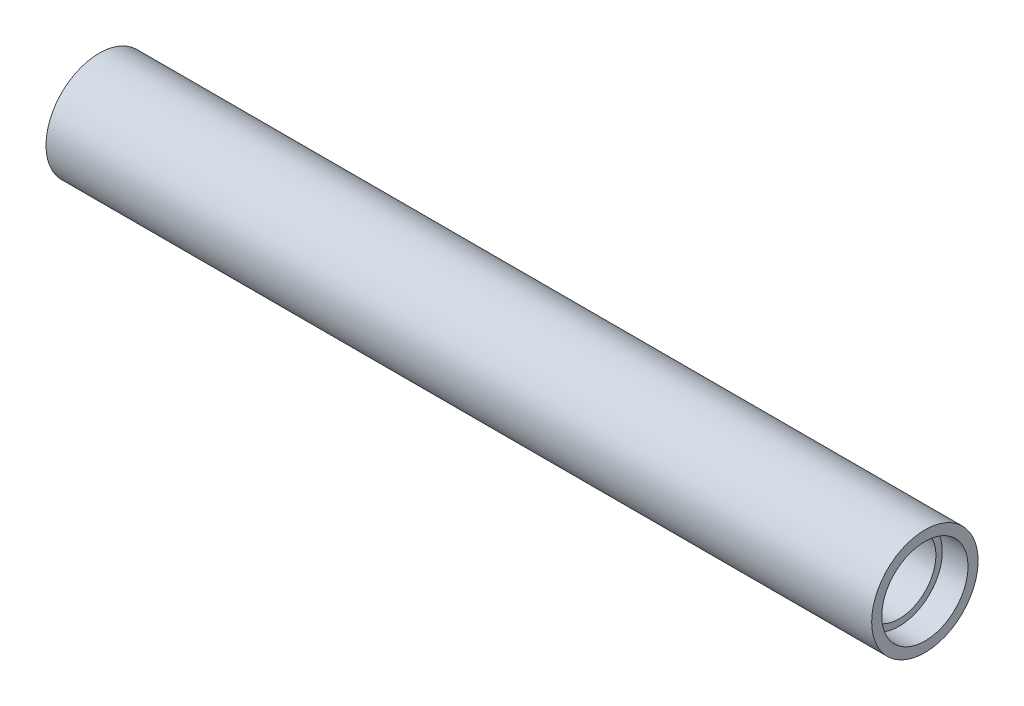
ISO-10303-21;
HEADER;
FILE_DESCRIPTION(('STEP AP214'),'2;1');
FILE_NAME('part.step','',(''),(''),'','','');
FILE_SCHEMA(('AUTOMOTIVE_DESIGN { 1 0 10303 214 1 1 1 1 }'));
ENDSEC;
DATA;
#1=APPLICATION_CONTEXT('core data for automotive mechanical design processes');
#2=APPLICATION_PROTOCOL_DEFINITION('international standard','automotive_design',2000,#1);
#3=PRODUCT_CONTEXT('',#1,'mechanical');
#4=PRODUCT('Part','Part','',(#3));
#5=PRODUCT_RELATED_PRODUCT_CATEGORY('part','',(#4));
#6=PRODUCT_DEFINITION_FORMATION('','',#4);
#7=PRODUCT_DEFINITION_CONTEXT('part definition',#1,'design');
#8=PRODUCT_DEFINITION('design','',#6,#7);
#9=PRODUCT_DEFINITION_SHAPE('','',#8);
#10=(LENGTH_UNIT() NAMED_UNIT(*) SI_UNIT(.MILLI.,.METRE.));
#11=(NAMED_UNIT(*) PLANE_ANGLE_UNIT() SI_UNIT($,.RADIAN.));
#12=(NAMED_UNIT(*) SI_UNIT($,.STERADIAN.) SOLID_ANGLE_UNIT());
#13=UNCERTAINTY_MEASURE_WITH_UNIT(LENGTH_MEASURE(1.E-05),#10,'distance_accuracy_value','');
#14=(GEOMETRIC_REPRESENTATION_CONTEXT(3) GLOBAL_UNCERTAINTY_ASSIGNED_CONTEXT((#13)) GLOBAL_UNIT_ASSIGNED_CONTEXT((#10,
#11,#12)) REPRESENTATION_CONTEXT('',''));
#15=CARTESIAN_POINT('',(0.,0.,0.));
#16=DIRECTION('',(0.,0.,1.));
#17=DIRECTION('',(1.,0.,0.));
#18=AXIS2_PLACEMENT_3D('',#15,#16,#17);
#19=CARTESIAN_POINT('',(225.,23.5000000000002,0.));
#20=DIRECTION('',(-1.,0.,0.));
#21=DIRECTION('',(0.,0.,1.));
#22=AXIS2_PLACEMENT_3D('',#19,#20,#21);
#23=PLANE('',#22);
#24=CARTESIAN_POINT('',(225.,0.,-4.44089209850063E-13));
#25=DIRECTION('',(-1.,0.,0.));
#26=DIRECTION('',(0.,0.,1.));
#27=AXIS2_PLACEMENT_3D('',#24,#25,#26);
#28=CIRCLE('',#27,29.);
#29=CARTESIAN_POINT('',(225.,0.,28.9999999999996));
#30=VERTEX_POINT('',#29);
#31=EDGE_CURVE('E70',#30,#30,#28,.T.);
#32=ORIENTED_EDGE('',*,*,#31,.F.);
#33=EDGE_LOOP('',(#32));
#34=FACE_BOUND('',#33,.T.);
#35=CARTESIAN_POINT('',(225.,0.,-4.44089209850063E-13));
#36=DIRECTION('',(-1.,0.,0.));
#37=DIRECTION('',(0.,0.,1.));
#38=AXIS2_PLACEMENT_3D('',#35,#36,#37);
#39=CIRCLE('',#38,23.5);
#40=CARTESIAN_POINT('',(225.,0.,23.4999999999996));
#41=VERTEX_POINT('',#40);
#42=EDGE_CURVE('E10',#41,#41,#39,.T.);
#43=ORIENTED_EDGE('',*,*,#42,.T.);
#44=EDGE_LOOP('',(#43));
#45=FACE_BOUND('',#44,.T.);
#46=ADVANCED_FACE('F34',(#34,#45),#23,.F.);
#47=CARTESIAN_POINT('',(-301.835158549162,0.,0.));
#48=DIRECTION('',(-1.,0.,0.));
#49=DIRECTION('',(0.,0.,1.));
#50=AXIS2_PLACEMENT_3D('',#47,#48,#49);
#51=CYLINDRICAL_SURFACE('',#50,23.5);
#52=ORIENTED_EDGE('',*,*,#42,.F.);
#53=EDGE_LOOP('',(#52));
#54=FACE_BOUND('',#53,.T.);
#55=CARTESIAN_POINT('',(211.,0.,0.));
#56=DIRECTION('',(-1.,0.,0.));
#57=DIRECTION('',(0.,0.,1.));
#58=AXIS2_PLACEMENT_3D('',#55,#56,#57);
#59=CIRCLE('',#58,23.5);
#60=CARTESIAN_POINT('',(211.,0.,23.5));
#61=VERTEX_POINT('',#60);
#62=EDGE_CURVE('E41',#61,#61,#59,.T.);
#63=ORIENTED_EDGE('',*,*,#62,.T.);
#64=EDGE_LOOP('',(#63));
#65=FACE_BOUND('',#64,.T.);
#66=ADVANCED_FACE('F77',(#54,#65),#51,.F.);
#67=CARTESIAN_POINT('',(211.,20.,0.));
#68=DIRECTION('',(-1.,0.,0.));
#69=DIRECTION('',(0.,0.,1.));
#70=AXIS2_PLACEMENT_3D('',#67,#68,#69);
#71=PLANE('',#70);
#72=ORIENTED_EDGE('',*,*,#62,.F.);
#73=EDGE_LOOP('',(#72));
#74=FACE_BOUND('',#73,.T.);
#75=CARTESIAN_POINT('',(211.,0.,0.));
#76=DIRECTION('',(-1.,0.,0.));
#77=DIRECTION('',(0.,0.,1.));
#78=AXIS2_PLACEMENT_3D('',#75,#76,#77);
#79=CIRCLE('',#78,20.);
#80=CARTESIAN_POINT('',(211.,0.,20.));
#81=VERTEX_POINT('',#80);
#82=EDGE_CURVE('E48',#81,#81,#79,.T.);
#83=ORIENTED_EDGE('',*,*,#82,.T.);
#84=EDGE_LOOP('',(#83));
#85=FACE_BOUND('',#84,.T.);
#86=ADVANCED_FACE('F81',(#74,#85),#71,.F.);
#87=CARTESIAN_POINT('',(-301.835158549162,0.,0.));
#88=DIRECTION('',(-1.,0.,0.));
#89=DIRECTION('',(0.,0.,1.));
#90=AXIS2_PLACEMENT_3D('',#87,#88,#89);
#91=CYLINDRICAL_SURFACE('',#90,20.);
#92=ORIENTED_EDGE('',*,*,#82,.F.);
#93=EDGE_LOOP('',(#92));
#94=FACE_BOUND('',#93,.T.);
#95=CARTESIAN_POINT('',(-211.,1.11022302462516E-13,0.));
#96=DIRECTION('',(-1.,0.,0.));
#97=DIRECTION('',(0.,0.,1.));
#98=AXIS2_PLACEMENT_3D('',#95,#96,#97);
#99=CIRCLE('',#98,20.);
#100=CARTESIAN_POINT('',(-211.,1.11022302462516E-13,20.));
#101=VERTEX_POINT('',#100);
#102=EDGE_CURVE('E54',#101,#101,#99,.T.);
#103=ORIENTED_EDGE('',*,*,#102,.T.);
#104=EDGE_LOOP('',(#103));
#105=FACE_BOUND('',#104,.T.);
#106=ADVANCED_FACE('F86',(#94,#105),#91,.F.);
#107=CARTESIAN_POINT('',(-211.,23.5,0.));
#108=DIRECTION('',(1.,0.,0.));
#109=DIRECTION('',(0.,0.,-1.));
#110=AXIS2_PLACEMENT_3D('',#107,#108,#109);
#111=PLANE('',#110);
#112=ORIENTED_EDGE('',*,*,#102,.F.);
#113=EDGE_LOOP('',(#112));
#114=FACE_BOUND('',#113,.T.);
#115=CARTESIAN_POINT('',(-211.,1.11022302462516E-13,0.));
#116=DIRECTION('',(-1.,0.,0.));
#117=DIRECTION('',(0.,0.,1.));
#118=AXIS2_PLACEMENT_3D('',#115,#116,#117);
#119=CIRCLE('',#118,23.5);
#120=CARTESIAN_POINT('',(-211.,1.11022302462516E-13,23.5));
#121=VERTEX_POINT('',#120);
#122=EDGE_CURVE('E59',#121,#121,#119,.T.);
#123=ORIENTED_EDGE('',*,*,#122,.T.);
#124=EDGE_LOOP('',(#123));
#125=FACE_BOUND('',#124,.T.);
#126=ADVANCED_FACE('F92',(#114,#125),#111,.F.);
#127=CARTESIAN_POINT('',(-301.835158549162,0.,0.));
#128=DIRECTION('',(-1.,0.,0.));
#129=DIRECTION('',(0.,0.,1.));
#130=AXIS2_PLACEMENT_3D('',#127,#128,#129);
#131=CYLINDRICAL_SURFACE('',#130,23.5);
#132=ORIENTED_EDGE('',*,*,#122,.F.);
#133=EDGE_LOOP('',(#132));
#134=FACE_BOUND('',#133,.T.);
#135=CARTESIAN_POINT('',(-225.,0.,0.));
#136=DIRECTION('',(-1.,0.,0.));
#137=DIRECTION('',(0.,0.,1.));
#138=AXIS2_PLACEMENT_3D('',#135,#136,#137);
#139=CIRCLE('',#138,23.5);
#140=CARTESIAN_POINT('',(-225.,0.,23.5));
#141=VERTEX_POINT('',#140);
#142=EDGE_CURVE('E62',#141,#141,#139,.T.);
#143=ORIENTED_EDGE('',*,*,#142,.T.);
#144=EDGE_LOOP('',(#143));
#145=FACE_BOUND('',#144,.T.);
#146=ADVANCED_FACE('F96',(#134,#145),#131,.F.);
#147=CARTESIAN_POINT('',(-225.,23.5000000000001,0.));
#148=DIRECTION('',(1.,0.,0.));
#149=DIRECTION('',(0.,0.,-1.));
#150=AXIS2_PLACEMENT_3D('',#147,#148,#149);
#151=PLANE('',#150);
#152=ORIENTED_EDGE('',*,*,#142,.F.);
#153=EDGE_LOOP('',(#152));
#154=FACE_BOUND('',#153,.T.);
#155=CARTESIAN_POINT('',(-225.,0.,0.));
#156=DIRECTION('',(-1.,0.,0.));
#157=DIRECTION('',(0.,0.,1.));
#158=AXIS2_PLACEMENT_3D('',#155,#156,#157);
#159=CIRCLE('',#158,29.);
#160=CARTESIAN_POINT('',(-225.,0.,29.));
#161=VERTEX_POINT('',#160);
#162=EDGE_CURVE('E66',#161,#161,#159,.T.);
#163=ORIENTED_EDGE('',*,*,#162,.T.);
#164=EDGE_LOOP('',(#163));
#165=FACE_BOUND('',#164,.T.);
#166=ADVANCED_FACE('F100',(#154,#165),#151,.F.);
#167=CARTESIAN_POINT('',(-301.835158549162,0.,0.));
#168=DIRECTION('',(-1.,0.,0.));
#169=DIRECTION('',(0.,0.,1.));
#170=AXIS2_PLACEMENT_3D('',#167,#168,#169);
#171=CYLINDRICAL_SURFACE('',#170,29.);
#172=ORIENTED_EDGE('',*,*,#162,.F.);
#173=EDGE_LOOP('',(#172));
#174=FACE_BOUND('',#173,.T.);
#175=ORIENTED_EDGE('',*,*,#31,.T.);
#176=EDGE_LOOP('',(#175));
#177=FACE_BOUND('',#176,.T.);
#178=ADVANCED_FACE('F74',(#174,#177),#171,.T.);
#179=CLOSED_SHELL('',(#46,#66,#86,#106,#126,#146,#166,#178));
#180=MANIFOLD_SOLID_BREP('B2',#179);
#181=ADVANCED_BREP_SHAPE_REPRESENTATION('',(#18,#180),#14);
#182=SHAPE_DEFINITION_REPRESENTATION(#9,#181);
ENDSEC;
END-ISO-10303-21;
